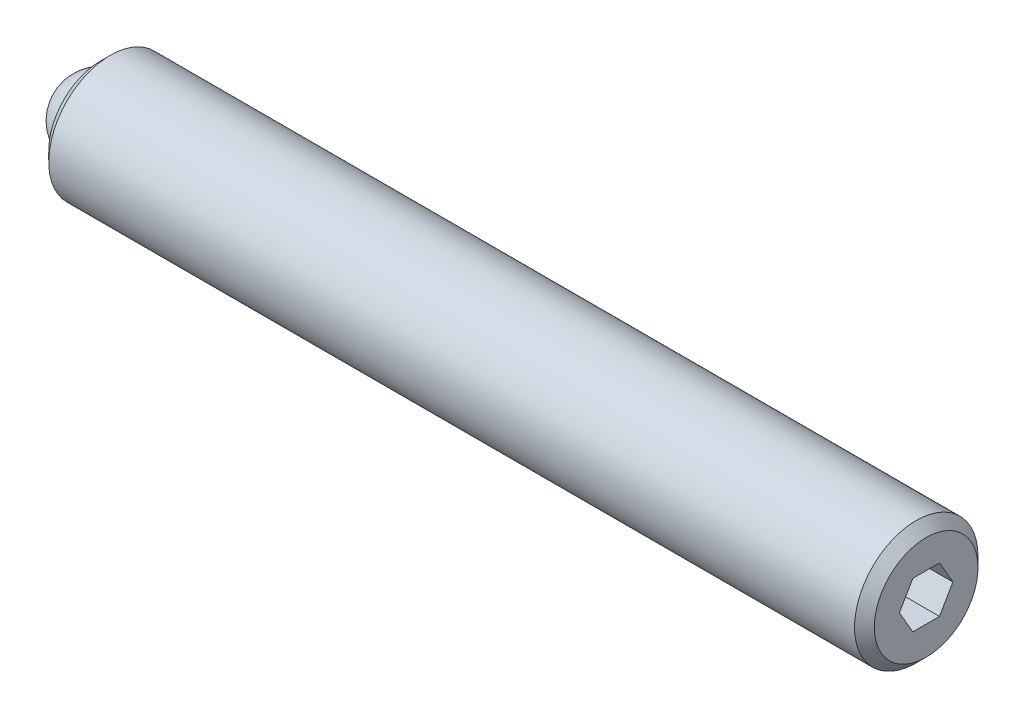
from build123d import *

# Parameters (mm, degrees)
SKETCH2_R           = 3.175
BOSS_EXTRUDE1_DEPTH = 42.465625
CHAMFER1_SIZE       = 0.508
CHAMFER2_SIZE       = 0.508
CUT_EXTRUDE2_DEPTH  = 2.286
SKETCH3_R           = 1.9812
CUT_EXTRUDE3_DEPTH  = 1.984375


with BuildPart() as part:
    # Sketch2 → Boss-Extrude1 (new body)
    with BuildSketch(Plane(origin=(0, 0, 0), x_dir=(0, 0, -1), z_dir=(1, 0, 0))):
        Circle(SKETCH2_R)
    extrude(amount=BOSS_EXTRUDE1_DEPTH)

    # Chamfer1
    chamfer1_edges = [part.edges().sort_by_distance(p)[0] for p in [
        (0, 0, 3.175),
    ]]
    chamfer(chamfer1_edges, length=CHAMFER1_SIZE)

    # Chamfer2
    chamfer2_edges = [part.edges().sort_by_distance(p)[0] for p in [
        (42.465625, 0, 3.175),
    ]]
    chamfer(chamfer2_edges, length=CHAMFER2_SIZE)

    # Sketch4 → Cut-Extrude2 (cut)
    with BuildSketch(Plane(origin=(42.465625, 0, 0), x_dir=(0, 0, -1), z_dir=(1, 0, 0))):
        Polygon((1.374815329, 0), (0.687407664, 1.190625), (-0.687407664, 1.190625), (-1.374815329, 0), (-0.687407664, -1.190625), (0.687407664, -1.190625), align=None)
    extrude(amount=-CUT_EXTRUDE2_DEPTH, mode=Mode.SUBTRACT)

    # Sketch3 → Cut-Extrude3 (cut)
    with BuildSketch(Plane.ZY):
        Circle(SKETCH3_R)
    extrude(amount=-CUT_EXTRUDE3_DEPTH, mode=Mode.SUBTRACT)


with BuildPart() as body_2:
    # Sketch5 → Revolve1 (revolve)
    with BuildSketch(Plane.ZY):
        with BuildLine():
            Line((0, 0), (0, -1.984375))
            ThreePointArc((0, -1.984375), (-1.984375, 0), (0, 1.984375))
            Line((0, 1.984375), (0, 0))
        make_face()
    revolve(axis=Axis((0, 0, 0), (0, 1, 0)))


solid = Compound([part.part, body_2.part])
